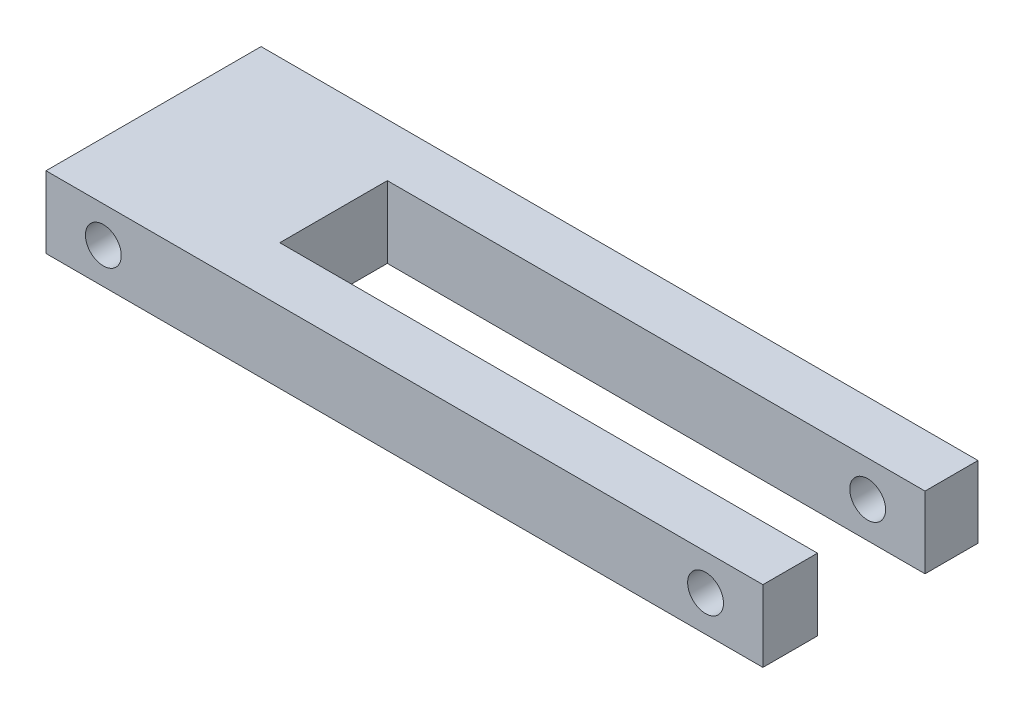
ISO-10303-21;
HEADER;
FILE_DESCRIPTION(('STEP AP214'),'2;1');
FILE_NAME('part.step','',(''),(''),'','','');
FILE_SCHEMA(('AUTOMOTIVE_DESIGN { 1 0 10303 214 1 1 1 1 }'));
ENDSEC;
DATA;
#1=APPLICATION_CONTEXT('core data for automotive mechanical design processes');
#2=APPLICATION_PROTOCOL_DEFINITION('international standard','automotive_design',2000,#1);
#3=PRODUCT_CONTEXT('',#1,'mechanical');
#4=PRODUCT('Part','Part','',(#3));
#5=PRODUCT_RELATED_PRODUCT_CATEGORY('part','',(#4));
#6=PRODUCT_DEFINITION_FORMATION('','',#4);
#7=PRODUCT_DEFINITION_CONTEXT('part definition',#1,'design');
#8=PRODUCT_DEFINITION('design','',#6,#7);
#9=PRODUCT_DEFINITION_SHAPE('','',#8);
#10=(LENGTH_UNIT() NAMED_UNIT(*) SI_UNIT(.MILLI.,.METRE.));
#11=(NAMED_UNIT(*) PLANE_ANGLE_UNIT() SI_UNIT($,.RADIAN.));
#12=(NAMED_UNIT(*) SI_UNIT($,.STERADIAN.) SOLID_ANGLE_UNIT());
#13=UNCERTAINTY_MEASURE_WITH_UNIT(LENGTH_MEASURE(1.E-05),#10,'distance_accuracy_value','');
#14=(GEOMETRIC_REPRESENTATION_CONTEXT(3) GLOBAL_UNCERTAINTY_ASSIGNED_CONTEXT((#13)) GLOBAL_UNIT_ASSIGNED_CONTEXT((#10,
#11,#12)) REPRESENTATION_CONTEXT('',''));
#15=CARTESIAN_POINT('',(0.,0.,0.));
#16=DIRECTION('',(0.,0.,1.));
#17=DIRECTION('',(1.,0.,0.));
#18=AXIS2_PLACEMENT_3D('',#15,#16,#17);
#19=CARTESIAN_POINT('',(-500.,-100.,152.207505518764));
#20=DIRECTION('',(0.,0.,-1.));
#21=DIRECTION('',(-1.,0.,0.));
#22=AXIS2_PLACEMENT_3D('',#19,#20,#21);
#23=PLANE('',#22);
#24=DIRECTION('',(-1.,0.,0.));
#25=VECTOR('',#24,1.);
#26=CARTESIAN_POINT('',(-500.,0.,152.207505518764));
#27=LINE('',#26,#25);
#28=CARTESIAN_POINT('',(500.,0.,152.207505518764));
#29=VERTEX_POINT('',#28);
#30=CARTESIAN_POINT('',(-500.,0.,152.207505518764));
#31=VERTEX_POINT('',#30);
#32=EDGE_CURVE('E128',#29,#31,#27,.T.);
#33=ORIENTED_EDGE('',*,*,#32,.T.);
#34=DIRECTION('',(0.,1.,0.));
#35=VECTOR('',#34,1.);
#36=CARTESIAN_POINT('',(-500.,-100.,152.207505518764));
#37=LINE('',#36,#35);
#38=CARTESIAN_POINT('',(-500.,-100.,152.207505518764));
#39=VERTEX_POINT('',#38);
#40=EDGE_CURVE('E125',#39,#31,#37,.T.);
#41=ORIENTED_EDGE('',*,*,#40,.F.);
#42=DIRECTION('',(-1.,0.,0.));
#43=VECTOR('',#42,1.);
#44=CARTESIAN_POINT('',(-500.,-100.,152.207505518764));
#45=LINE('',#44,#43);
#46=CARTESIAN_POINT('',(500.,-100.,152.207505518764));
#47=VERTEX_POINT('',#46);
#48=EDGE_CURVE('E113',#47,#39,#45,.T.);
#49=ORIENTED_EDGE('',*,*,#48,.F.);
#50=DIRECTION('',(0.,1.,0.));
#51=VECTOR('',#50,1.);
#52=CARTESIAN_POINT('',(500.,-100.,152.207505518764));
#53=LINE('',#52,#51);
#54=EDGE_CURVE('E130',#47,#29,#53,.T.);
#55=ORIENTED_EDGE('',*,*,#54,.T.);
#56=EDGE_LOOP('',(#33,#41,#49,#55));
#57=FACE_BOUND('',#56,.T.);
#58=CARTESIAN_POINT('',(-420.,-50.0000000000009,152.207505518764));
#59=DIRECTION('',(0.,0.,-1.));
#60=DIRECTION('',(-1.,0.,0.));
#61=AXIS2_PLACEMENT_3D('',#58,#59,#60);
#62=CIRCLE('',#61,25.);
#63=CARTESIAN_POINT('',(-445.,-50.0000000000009,152.207505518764));
#64=VERTEX_POINT('',#63);
#65=EDGE_CURVE('E221',#64,#64,#62,.T.);
#66=ORIENTED_EDGE('',*,*,#65,.T.);
#67=EDGE_LOOP('',(#66));
#68=FACE_BOUND('',#67,.T.);
#69=CARTESIAN_POINT('',(420.,-50.,152.207505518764));
#70=DIRECTION('',(0.,0.,-1.));
#71=DIRECTION('',(-1.,0.,0.));
#72=AXIS2_PLACEMENT_3D('',#69,#70,#71);
#73=CIRCLE('',#72,25.);
#74=CARTESIAN_POINT('',(395.,-50.,152.207505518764));
#75=VERTEX_POINT('',#74);
#76=EDGE_CURVE('E215',#75,#75,#73,.F.);
#77=ORIENTED_EDGE('',*,*,#76,.F.);
#78=EDGE_LOOP('',(#77));
#79=FACE_BOUND('',#78,.T.);
#80=ADVANCED_FACE('F39',(#57,#68,#79),#23,.F.);
#81=CARTESIAN_POINT('',(500.,-100.,-147.792494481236));
#82=DIRECTION('',(0.,0.,1.));
#83=DIRECTION('',(1.,0.,0.));
#84=AXIS2_PLACEMENT_3D('',#81,#82,#83);
#85=PLANE('',#84);
#86=DIRECTION('',(1.,0.,0.));
#87=VECTOR('',#86,1.);
#88=CARTESIAN_POINT('',(500.,0.,-147.792494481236));
#89=LINE('',#88,#87);
#90=CARTESIAN_POINT('',(-500.,0.,-147.792494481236));
#91=VERTEX_POINT('',#90);
#92=CARTESIAN_POINT('',(500.,0.,-147.792494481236));
#93=VERTEX_POINT('',#92);
#94=EDGE_CURVE('E92',#91,#93,#89,.T.);
#95=ORIENTED_EDGE('',*,*,#94,.T.);
#96=DIRECTION('',(0.,1.,0.));
#97=VECTOR('',#96,1.);
#98=CARTESIAN_POINT('',(500.,-100.,-147.792494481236));
#99=LINE('',#98,#97);
#100=CARTESIAN_POINT('',(500.,-100.,-147.792494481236));
#101=VERTEX_POINT('',#100);
#102=EDGE_CURVE('E137',#101,#93,#99,.T.);
#103=ORIENTED_EDGE('',*,*,#102,.F.);
#104=DIRECTION('',(1.,0.,0.));
#105=VECTOR('',#104,1.);
#106=CARTESIAN_POINT('',(500.,-100.,-147.792494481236));
#107=LINE('',#106,#105);
#108=CARTESIAN_POINT('',(-500.,-100.,-147.792494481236));
#109=VERTEX_POINT('',#108);
#110=EDGE_CURVE('E57',#109,#101,#107,.T.);
#111=ORIENTED_EDGE('',*,*,#110,.F.);
#112=DIRECTION('',(0.,1.,0.));
#113=VECTOR('',#112,1.);
#114=CARTESIAN_POINT('',(-500.,-100.,-147.792494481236));
#115=LINE('',#114,#113);
#116=EDGE_CURVE('E131',#109,#91,#115,.T.);
#117=ORIENTED_EDGE('',*,*,#116,.T.);
#118=EDGE_LOOP('',(#95,#103,#111,#117));
#119=FACE_BOUND('',#118,.T.);
#120=CARTESIAN_POINT('',(-420.,-50.0000000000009,-147.792494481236));
#121=DIRECTION('',(0.,0.,1.));
#122=DIRECTION('',(1.,0.,0.));
#123=AXIS2_PLACEMENT_3D('',#120,#121,#122);
#124=CIRCLE('',#123,25.);
#125=CARTESIAN_POINT('',(-445.,-50.0000000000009,-147.792494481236));
#126=VERTEX_POINT('',#125);
#127=EDGE_CURVE('E216',#126,#126,#124,.T.);
#128=ORIENTED_EDGE('',*,*,#127,.T.);
#129=EDGE_LOOP('',(#128));
#130=FACE_BOUND('',#129,.T.);
#131=CARTESIAN_POINT('',(420.,-50.,-147.792494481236));
#132=DIRECTION('',(0.,0.,-1.));
#133=DIRECTION('',(-1.,0.,0.));
#134=AXIS2_PLACEMENT_3D('',#131,#132,#133);
#135=CIRCLE('',#134,25.);
#136=CARTESIAN_POINT('',(395.,-50.,-147.792494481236));
#137=VERTEX_POINT('',#136);
#138=EDGE_CURVE('E220',#137,#137,#135,.T.);
#139=ORIENTED_EDGE('',*,*,#138,.F.);
#140=EDGE_LOOP('',(#139));
#141=FACE_BOUND('',#140,.T.);
#142=ADVANCED_FACE('F235',(#119,#130,#141),#85,.F.);
#143=CARTESIAN_POINT('',(500.,-100.,-147.792494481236));
#144=DIRECTION('',(-1.,0.,0.));
#145=DIRECTION('',(0.,0.,1.));
#146=AXIS2_PLACEMENT_3D('',#143,#144,#145);
#147=PLANE('',#146);
#148=DIRECTION('',(0.,0.,1.));
#149=VECTOR('',#148,1.);
#150=CARTESIAN_POINT('',(500.,0.,-147.792494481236));
#151=LINE('',#150,#149);
#152=CARTESIAN_POINT('',(500.,0.,-73.8962472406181));
#153=VERTEX_POINT('',#152);
#154=EDGE_CURVE('E141',#93,#153,#151,.T.);
#155=ORIENTED_EDGE('',*,*,#154,.T.);
#156=DIRECTION('',(0.,1.,0.));
#157=VECTOR('',#156,1.);
#158=CARTESIAN_POINT('',(500.,-100.,-73.8962472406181));
#159=LINE('',#158,#157);
#160=CARTESIAN_POINT('',(500.,-100.,-73.8962472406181));
#161=VERTEX_POINT('',#160);
#162=EDGE_CURVE('E11',#161,#153,#159,.T.);
#163=ORIENTED_EDGE('',*,*,#162,.F.);
#164=DIRECTION('',(0.,0.,1.));
#165=VECTOR('',#164,1.);
#166=CARTESIAN_POINT('',(500.,-100.,-147.792494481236));
#167=LINE('',#166,#165);
#168=EDGE_CURVE('E164',#101,#161,#167,.T.);
#169=ORIENTED_EDGE('',*,*,#168,.F.);
#170=ORIENTED_EDGE('',*,*,#102,.T.);
#171=EDGE_LOOP('',(#155,#163,#169,#170));
#172=FACE_BOUND('',#171,.T.);
#173=ADVANCED_FACE('F41',(#172),#147,.F.);
#174=CARTESIAN_POINT('',(500.,-100.,-73.8962472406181));
#175=DIRECTION('',(0.,0.,-1.));
#176=DIRECTION('',(-1.,0.,0.));
#177=AXIS2_PLACEMENT_3D('',#174,#175,#176);
#178=PLANE('',#177);
#179=CARTESIAN_POINT('',(420.,-50.,-73.8962472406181));
#180=DIRECTION('',(0.,0.,-1.));
#181=DIRECTION('',(-1.,0.,0.));
#182=AXIS2_PLACEMENT_3D('',#179,#180,#181);
#183=CIRCLE('',#182,25.);
#184=CARTESIAN_POINT('',(395.,-50.,-73.8962472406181));
#185=VERTEX_POINT('',#184);
#186=EDGE_CURVE('E146',#185,#185,#183,.T.);
#187=ORIENTED_EDGE('',*,*,#186,.T.);
#188=EDGE_LOOP('',(#187));
#189=FACE_BOUND('',#188,.T.);
#190=DIRECTION('',(-1.,0.,0.));
#191=VECTOR('',#190,1.);
#192=CARTESIAN_POINT('',(500.,0.,-73.8962472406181));
#193=LINE('',#192,#191);
#194=CARTESIAN_POINT('',(-250.,0.,-73.8962472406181));
#195=VERTEX_POINT('',#194);
#196=EDGE_CURVE('E145',#153,#195,#193,.T.);
#197=ORIENTED_EDGE('',*,*,#196,.T.);
#198=DIRECTION('',(0.,1.,0.));
#199=VECTOR('',#198,1.);
#200=CARTESIAN_POINT('',(-250.,-100.,-73.8962472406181));
#201=LINE('',#200,#199);
#202=CARTESIAN_POINT('',(-250.,-100.,-73.8962472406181));
#203=VERTEX_POINT('',#202);
#204=EDGE_CURVE('E49',#203,#195,#201,.T.);
#205=ORIENTED_EDGE('',*,*,#204,.F.);
#206=DIRECTION('',(-1.,0.,0.));
#207=VECTOR('',#206,1.);
#208=CARTESIAN_POINT('',(500.,-100.,-73.8962472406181));
#209=LINE('',#208,#207);
#210=EDGE_CURVE('E100',#161,#203,#209,.T.);
#211=ORIENTED_EDGE('',*,*,#210,.F.);
#212=ORIENTED_EDGE('',*,*,#162,.T.);
#213=EDGE_LOOP('',(#197,#205,#211,#212));
#214=FACE_BOUND('',#213,.T.);
#215=ADVANCED_FACE('F242',(#189,#214),#178,.F.);
#216=CARTESIAN_POINT('',(-250.,-100.,-73.8962472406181));
#217=DIRECTION('',(-1.,0.,0.));
#218=DIRECTION('',(0.,0.,1.));
#219=AXIS2_PLACEMENT_3D('',#216,#217,#218);
#220=PLANE('',#219);
#221=DIRECTION('',(0.,0.,1.));
#222=VECTOR('',#221,1.);
#223=CARTESIAN_POINT('',(-250.,0.,-73.8962472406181));
#224=LINE('',#223,#222);
#225=CARTESIAN_POINT('',(-250.,0.,76.1037527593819));
#226=VERTEX_POINT('',#225);
#227=EDGE_CURVE('E149',#195,#226,#224,.T.);
#228=ORIENTED_EDGE('',*,*,#227,.T.);
#229=DIRECTION('',(0.,1.,0.));
#230=VECTOR('',#229,1.);
#231=CARTESIAN_POINT('',(-250.,-100.,76.1037527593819));
#232=LINE('',#231,#230);
#233=CARTESIAN_POINT('',(-250.,-100.,76.1037527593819));
#234=VERTEX_POINT('',#233);
#235=EDGE_CURVE('E175',#234,#226,#232,.T.);
#236=ORIENTED_EDGE('',*,*,#235,.F.);
#237=DIRECTION('',(0.,0.,1.));
#238=VECTOR('',#237,1.);
#239=CARTESIAN_POINT('',(-250.,-100.,-73.8962472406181));
#240=LINE('',#239,#238);
#241=EDGE_CURVE('E185',#203,#234,#240,.T.);
#242=ORIENTED_EDGE('',*,*,#241,.F.);
#243=ORIENTED_EDGE('',*,*,#204,.T.);
#244=EDGE_LOOP('',(#228,#236,#242,#243));
#245=FACE_BOUND('',#244,.T.);
#246=ADVANCED_FACE('F183',(#245),#220,.F.);
#247=CARTESIAN_POINT('',(-250.,-100.,76.1037527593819));
#248=DIRECTION('',(0.,0.,1.));
#249=DIRECTION('',(1.,0.,0.));
#250=AXIS2_PLACEMENT_3D('',#247,#248,#249);
#251=PLANE('',#250);
#252=CARTESIAN_POINT('',(420.,-50.,76.1037527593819));
#253=DIRECTION('',(0.,0.,1.));
#254=DIRECTION('',(1.,0.,0.));
#255=AXIS2_PLACEMENT_3D('',#252,#253,#254);
#256=CIRCLE('',#255,25.);
#257=CARTESIAN_POINT('',(395.,-50.,76.1037527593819));
#258=VERTEX_POINT('',#257);
#259=EDGE_CURVE('E211',#258,#258,#256,.T.);
#260=ORIENTED_EDGE('',*,*,#259,.T.);
#261=EDGE_LOOP('',(#260));
#262=FACE_BOUND('',#261,.T.);
#263=DIRECTION('',(1.,0.,0.));
#264=VECTOR('',#263,1.);
#265=CARTESIAN_POINT('',(-250.,0.,76.1037527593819));
#266=LINE('',#265,#264);
#267=CARTESIAN_POINT('',(500.,0.,76.1037527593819));
#268=VERTEX_POINT('',#267);
#269=EDGE_CURVE('E152',#226,#268,#266,.T.);
#270=ORIENTED_EDGE('',*,*,#269,.T.);
#271=DIRECTION('',(0.,1.,0.));
#272=VECTOR('',#271,1.);
#273=CARTESIAN_POINT('',(500.,-100.,76.1037527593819));
#274=LINE('',#273,#272);
#275=CARTESIAN_POINT('',(500.,-100.,76.1037527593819));
#276=VERTEX_POINT('',#275);
#277=EDGE_CURVE('E171',#276,#268,#274,.T.);
#278=ORIENTED_EDGE('',*,*,#277,.F.);
#279=DIRECTION('',(1.,0.,0.));
#280=VECTOR('',#279,1.);
#281=CARTESIAN_POINT('',(-250.,-100.,76.1037527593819));
#282=LINE('',#281,#280);
#283=EDGE_CURVE('E198',#234,#276,#282,.T.);
#284=ORIENTED_EDGE('',*,*,#283,.F.);
#285=ORIENTED_EDGE('',*,*,#235,.T.);
#286=EDGE_LOOP('',(#270,#278,#284,#285));
#287=FACE_BOUND('',#286,.T.);
#288=ADVANCED_FACE('F193',(#262,#287),#251,.F.);
#289=CARTESIAN_POINT('',(500.,-100.,76.1037527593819));
#290=DIRECTION('',(-1.,0.,0.));
#291=DIRECTION('',(0.,0.,1.));
#292=AXIS2_PLACEMENT_3D('',#289,#290,#291);
#293=PLANE('',#292);
#294=DIRECTION('',(0.,0.,1.));
#295=VECTOR('',#294,1.);
#296=CARTESIAN_POINT('',(500.,0.,76.1037527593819));
#297=LINE('',#296,#295);
#298=EDGE_CURVE('E155',#268,#29,#297,.T.);
#299=ORIENTED_EDGE('',*,*,#298,.T.);
#300=ORIENTED_EDGE('',*,*,#54,.F.);
#301=DIRECTION('',(0.,0.,1.));
#302=VECTOR('',#301,1.);
#303=CARTESIAN_POINT('',(500.,-100.,76.1037527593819));
#304=LINE('',#303,#302);
#305=EDGE_CURVE('E119',#276,#47,#304,.T.);
#306=ORIENTED_EDGE('',*,*,#305,.F.);
#307=ORIENTED_EDGE('',*,*,#277,.T.);
#308=EDGE_LOOP('',(#299,#300,#306,#307));
#309=FACE_BOUND('',#308,.T.);
#310=ADVANCED_FACE('F196',(#309),#293,.F.);
#311=CARTESIAN_POINT('',(-500.,-100.,-147.792494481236));
#312=DIRECTION('',(1.,0.,0.));
#313=DIRECTION('',(0.,0.,-1.));
#314=AXIS2_PLACEMENT_3D('',#311,#312,#313);
#315=PLANE('',#314);
#316=DIRECTION('',(0.,0.,-1.));
#317=VECTOR('',#316,1.);
#318=CARTESIAN_POINT('',(-500.,0.,-147.792494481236));
#319=LINE('',#318,#317);
#320=EDGE_CURVE('E86',#31,#91,#319,.T.);
#321=ORIENTED_EDGE('',*,*,#320,.T.);
#322=ORIENTED_EDGE('',*,*,#116,.F.);
#323=DIRECTION('',(0.,0.,-1.));
#324=VECTOR('',#323,1.);
#325=CARTESIAN_POINT('',(-500.,-100.,-147.792494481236));
#326=LINE('',#325,#324);
#327=EDGE_CURVE('E117',#39,#109,#326,.T.);
#328=ORIENTED_EDGE('',*,*,#327,.F.);
#329=ORIENTED_EDGE('',*,*,#40,.T.);
#330=EDGE_LOOP('',(#321,#322,#328,#329));
#331=FACE_BOUND('',#330,.T.);
#332=ADVANCED_FACE('F133',(#331),#315,.F.);
#333=CARTESIAN_POINT('',(0.,-100.,0.));
#334=DIRECTION('',(0.,-1.,0.));
#335=DIRECTION('',(0.,0.,-1.));
#336=AXIS2_PLACEMENT_3D('',#333,#334,#335);
#337=PLANE('',#336);
#338=ORIENTED_EDGE('',*,*,#168,.T.);
#339=ORIENTED_EDGE('',*,*,#210,.T.);
#340=ORIENTED_EDGE('',*,*,#241,.T.);
#341=ORIENTED_EDGE('',*,*,#283,.T.);
#342=ORIENTED_EDGE('',*,*,#305,.T.);
#343=ORIENTED_EDGE('',*,*,#48,.T.);
#344=ORIENTED_EDGE('',*,*,#327,.T.);
#345=ORIENTED_EDGE('',*,*,#110,.T.);
#346=EDGE_LOOP('',(#338,#339,#340,#341,#342,#343,#344,#345));
#347=FACE_BOUND('',#346,.T.);
#348=ADVANCED_FACE('F115',(#347),#337,.T.);
#349=CARTESIAN_POINT('',(0.,0.,0.));
#350=DIRECTION('',(0.,-1.,0.));
#351=DIRECTION('',(0.,0.,-1.));
#352=AXIS2_PLACEMENT_3D('',#349,#350,#351);
#353=PLANE('',#352);
#354=ORIENTED_EDGE('',*,*,#154,.F.);
#355=ORIENTED_EDGE('',*,*,#94,.F.);
#356=ORIENTED_EDGE('',*,*,#320,.F.);
#357=ORIENTED_EDGE('',*,*,#32,.F.);
#358=ORIENTED_EDGE('',*,*,#298,.F.);
#359=ORIENTED_EDGE('',*,*,#269,.F.);
#360=ORIENTED_EDGE('',*,*,#227,.F.);
#361=ORIENTED_EDGE('',*,*,#196,.F.);
#362=EDGE_LOOP('',(#354,#355,#356,#357,#358,#359,#360,#361));
#363=FACE_BOUND('',#362,.T.);
#364=ADVANCED_FACE('F189',(#363),#353,.F.);
#365=CARTESIAN_POINT('',(-420.,-50.0000000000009,222.918183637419));
#366=DIRECTION('',(0.,0.,-1.));
#367=DIRECTION('',(-1.,0.,0.));
#368=AXIS2_PLACEMENT_3D('',#365,#366,#367);
#369=CYLINDRICAL_SURFACE('',#368,25.);
#370=CARTESIAN_POINT('',(-445.,-50.0000000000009,152.207505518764));
#371=CARTESIAN_POINT('',(-445.,-50.0000000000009,149.082505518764));
#372=CARTESIAN_POINT('',(-445.,-50.0000000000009,145.957505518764));
#373=CARTESIAN_POINT('',(-445.,-50.0000000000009,139.707505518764));
#374=CARTESIAN_POINT('',(-445.,-50.0000000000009,136.582505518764));
#375=CARTESIAN_POINT('',(-445.,-50.0000000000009,130.332505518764));
#376=CARTESIAN_POINT('',(-445.,-50.0000000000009,127.207505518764));
#377=CARTESIAN_POINT('',(-445.,-50.0000000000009,120.957505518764));
#378=CARTESIAN_POINT('',(-445.,-50.0000000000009,117.832505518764));
#379=CARTESIAN_POINT('',(-445.,-50.0000000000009,111.582505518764));
#380=CARTESIAN_POINT('',(-445.,-50.0000000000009,108.457505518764));
#381=CARTESIAN_POINT('',(-445.,-50.0000000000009,102.207505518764));
#382=CARTESIAN_POINT('',(-445.,-50.0000000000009,99.0825055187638));
#383=CARTESIAN_POINT('',(-445.,-50.0000000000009,92.8325055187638));
#384=CARTESIAN_POINT('',(-445.,-50.0000000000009,89.7075055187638));
#385=CARTESIAN_POINT('',(-445.,-50.0000000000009,83.4575055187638));
#386=CARTESIAN_POINT('',(-445.,-50.0000000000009,80.3325055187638));
#387=CARTESIAN_POINT('',(-445.,-50.0000000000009,74.0825055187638));
#388=CARTESIAN_POINT('',(-445.,-50.0000000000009,70.9575055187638));
#389=CARTESIAN_POINT('',(-445.,-50.0000000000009,64.7075055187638));
#390=CARTESIAN_POINT('',(-445.,-50.0000000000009,61.5825055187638));
#391=CARTESIAN_POINT('',(-445.,-50.0000000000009,55.3325055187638));
#392=CARTESIAN_POINT('',(-445.,-50.0000000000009,52.2075055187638));
#393=CARTESIAN_POINT('',(-445.,-50.0000000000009,45.9575055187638));
#394=CARTESIAN_POINT('',(-445.,-50.0000000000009,42.8325055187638));
#395=CARTESIAN_POINT('',(-445.,-50.0000000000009,36.5825055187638));
#396=CARTESIAN_POINT('',(-445.,-50.0000000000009,33.4575055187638));
#397=CARTESIAN_POINT('',(-445.,-50.0000000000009,27.2075055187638));
#398=CARTESIAN_POINT('',(-445.,-50.0000000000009,24.0825055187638));
#399=CARTESIAN_POINT('',(-445.,-50.0000000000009,17.8325055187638));
#400=CARTESIAN_POINT('',(-445.,-50.0000000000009,14.7075055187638));
#401=CARTESIAN_POINT('',(-445.,-50.0000000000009,8.45750551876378));
#402=CARTESIAN_POINT('',(-445.,-50.0000000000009,5.33250551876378));
#403=CARTESIAN_POINT('',(-445.,-50.0000000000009,-0.917494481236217));
#404=CARTESIAN_POINT('',(-445.,-50.0000000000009,-4.04249448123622));
#405=CARTESIAN_POINT('',(-445.,-50.0000000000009,-10.2924944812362));
#406=CARTESIAN_POINT('',(-445.,-50.0000000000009,-13.4174944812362));
#407=CARTESIAN_POINT('',(-445.,-50.0000000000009,-19.6674944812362));
#408=CARTESIAN_POINT('',(-445.,-50.0000000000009,-22.7924944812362));
#409=CARTESIAN_POINT('',(-445.,-50.0000000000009,-29.0424944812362));
#410=CARTESIAN_POINT('',(-445.,-50.0000000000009,-32.1674944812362));
#411=CARTESIAN_POINT('',(-445.,-50.0000000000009,-38.4174944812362));
#412=CARTESIAN_POINT('',(-445.,-50.0000000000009,-41.5424944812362));
#413=CARTESIAN_POINT('',(-445.,-50.0000000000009,-47.7924944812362));
#414=CARTESIAN_POINT('',(-445.,-50.0000000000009,-50.9174944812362));
#415=CARTESIAN_POINT('',(-445.,-50.0000000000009,-57.1674944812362));
#416=CARTESIAN_POINT('',(-445.,-50.0000000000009,-60.2924944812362));
#417=CARTESIAN_POINT('',(-445.,-50.0000000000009,-66.5424944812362));
#418=CARTESIAN_POINT('',(-445.,-50.0000000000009,-69.6674944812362));
#419=CARTESIAN_POINT('',(-445.,-50.0000000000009,-75.9174944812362));
#420=CARTESIAN_POINT('',(-445.,-50.0000000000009,-79.0424944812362));
#421=CARTESIAN_POINT('',(-445.,-50.0000000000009,-85.2924944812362));
#422=CARTESIAN_POINT('',(-445.,-50.0000000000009,-88.4174944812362));
#423=CARTESIAN_POINT('',(-445.,-50.0000000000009,-94.6674944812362));
#424=CARTESIAN_POINT('',(-445.,-50.0000000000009,-97.7924944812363));
#425=CARTESIAN_POINT('',(-445.,-50.0000000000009,-104.042494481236));
#426=CARTESIAN_POINT('',(-445.,-50.0000000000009,-107.167494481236));
#427=CARTESIAN_POINT('',(-445.,-50.0000000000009,-113.417494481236));
#428=CARTESIAN_POINT('',(-445.,-50.0000000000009,-116.542494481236));
#429=CARTESIAN_POINT('',(-445.,-50.0000000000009,-122.792494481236));
#430=CARTESIAN_POINT('',(-445.,-50.0000000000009,-125.917494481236));
#431=CARTESIAN_POINT('',(-445.,-50.0000000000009,-132.167494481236));
#432=CARTESIAN_POINT('',(-445.,-50.0000000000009,-135.292494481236));
#433=CARTESIAN_POINT('',(-445.,-50.0000000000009,-141.542494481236));
#434=CARTESIAN_POINT('',(-445.,-50.0000000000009,-144.667494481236));
#435=CARTESIAN_POINT('',(-445.,-50.0000000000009,-147.792494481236));
#436=B_SPLINE_CURVE_WITH_KNOTS('',3,(#370,#371,#372,#373,#374,#375,#376,#377,#378,#379,#380,
#381,#382,#383,#384,#385,#386,#387,#388,#389,#390,#391,#392,#393,#394,#395,#396,#397,#398,#399,
#400,#401,#402,#403,#404,#405,#406,#407,#408,#409,#410,#411,#412,#413,#414,#415,#416,#417,#418,
#419,#420,#421,#422,#423,#424,#425,#426,#427,#428,#429,#430,#431,#432,#433,#434,#435),
.UNSPECIFIED.,.F.,.F.,(4,2,2,2,2,2,2,2,2,2,2,2,2,2,2,2,2,2,2,2,2,2,2,2,2,2,2,2,2,2,2,2,4),(0.,
9.37499999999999,18.75,28.125,37.5,46.875,56.25,65.625,75.,84.375,93.75,103.125,112.5,121.875,
131.25,140.625,150.,159.375,168.75,178.125,187.5,196.875,206.25,215.625,225.,234.375,243.75,
253.125,262.5,271.875,281.25,290.625,300.),.UNSPECIFIED.);
#437=EDGE_CURVE('BSEAM266',#64,#126,#436,.T.);
#438=ORIENTED_EDGE('',*,*,#65,.F.);
#439=ORIENTED_EDGE('',*,*,#127,.F.);
#440=ORIENTED_EDGE('',*,*,#437,.T.);
#441=ORIENTED_EDGE('',*,*,#437,.F.);
#442=EDGE_LOOP('',(#438,#440,#439,#441));
#443=FACE_BOUND('',#442,.T.);
#444=ADVANCED_FACE('F266',(#443),#369,.F.);
#445=CARTESIAN_POINT('',(420.,-50.,222.918183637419));
#446=DIRECTION('',(0.,0.,-1.));
#447=DIRECTION('',(-1.,0.,0.));
#448=AXIS2_PLACEMENT_3D('',#445,#446,#447);
#449=CYLINDRICAL_SURFACE('',#448,25.);
#450=CARTESIAN_POINT('',(395.,-50.,-147.792494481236));
#451=CARTESIAN_POINT('',(395.,-50.,-147.022741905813));
#452=CARTESIAN_POINT('',(395.,-50.,-146.25298933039));
#453=CARTESIAN_POINT('',(395.,-50.,-144.713484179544));
#454=CARTESIAN_POINT('',(395.,-50.,-143.943731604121));
#455=CARTESIAN_POINT('',(395.,-50.,-142.404226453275));
#456=CARTESIAN_POINT('',(395.,-50.,-141.634473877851));
#457=CARTESIAN_POINT('',(395.,-50.,-140.094968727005));
#458=CARTESIAN_POINT('',(395.,-50.,-139.325216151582));
#459=CARTESIAN_POINT('',(395.,-50.,-137.785711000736));
#460=CARTESIAN_POINT('',(395.,-50.,-137.015958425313));
#461=CARTESIAN_POINT('',(395.,-50.,-135.476453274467));
#462=CARTESIAN_POINT('',(395.,-50.,-134.706700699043));
#463=CARTESIAN_POINT('',(395.,-50.,-133.167195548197));
#464=CARTESIAN_POINT('',(395.,-50.,-132.397442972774));
#465=CARTESIAN_POINT('',(395.,-50.,-130.857937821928));
#466=CARTESIAN_POINT('',(395.,-50.,-130.088185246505));
#467=CARTESIAN_POINT('',(395.,-50.,-128.548680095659));
#468=CARTESIAN_POINT('',(395.,-50.,-127.778927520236));
#469=CARTESIAN_POINT('',(395.,-50.,-126.239422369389));
#470=CARTESIAN_POINT('',(395.,-50.,-125.469669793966));
#471=CARTESIAN_POINT('',(395.,-50.,-123.93016464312));
#472=CARTESIAN_POINT('',(395.,-50.,-123.160412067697));
#473=CARTESIAN_POINT('',(395.,-50.,-121.620906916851));
#474=CARTESIAN_POINT('',(395.,-50.,-120.851154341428));
#475=CARTESIAN_POINT('',(395.,-50.,-119.311649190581));
#476=CARTESIAN_POINT('',(395.,-50.,-118.541896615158));
#477=CARTESIAN_POINT('',(395.,-50.,-117.002391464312));
#478=CARTESIAN_POINT('',(395.,-50.,-116.232638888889));
#479=CARTESIAN_POINT('',(395.,-50.,-114.693133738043));
#480=CARTESIAN_POINT('',(395.,-50.,-113.92338116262));
#481=CARTESIAN_POINT('',(395.,-50.,-112.383876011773));
#482=CARTESIAN_POINT('',(395.,-50.,-111.61412343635));
#483=CARTESIAN_POINT('',(395.,-50.,-110.074618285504));
#484=CARTESIAN_POINT('',(395.,-50.,-109.304865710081));
#485=CARTESIAN_POINT('',(395.,-50.,-107.765360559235));
#486=CARTESIAN_POINT('',(395.,-50.,-106.995607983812));
#487=CARTESIAN_POINT('',(395.,-50.,-105.456102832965));
#488=CARTESIAN_POINT('',(395.,-50.,-104.686350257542));
#489=CARTESIAN_POINT('',(395.,-50.,-103.146845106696));
#490=CARTESIAN_POINT('',(395.,-50.,-102.377092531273));
#491=CARTESIAN_POINT('',(395.,-50.,-100.837587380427));
#492=CARTESIAN_POINT('',(395.,-50.,-100.067834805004));
#493=CARTESIAN_POINT('',(395.,-50.,-98.5283296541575));
#494=CARTESIAN_POINT('',(395.,-50.,-97.7585770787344));
#495=CARTESIAN_POINT('',(395.,-50.,-96.2190719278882));
#496=CARTESIAN_POINT('',(395.,-50.,-95.4493193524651));
#497=CARTESIAN_POINT('',(395.,-50.,-93.9098142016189));
#498=CARTESIAN_POINT('',(395.,-50.,-93.1400616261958));
#499=CARTESIAN_POINT('',(395.,-50.,-91.6005564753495));
#500=CARTESIAN_POINT('',(395.,-50.,-90.8308038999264));
#501=CARTESIAN_POINT('',(395.,-50.,-89.2912987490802));
#502=CARTESIAN_POINT('',(395.,-50.,-88.5215461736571));
#503=CARTESIAN_POINT('',(395.,-50.,-86.9820410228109));
#504=CARTESIAN_POINT('',(395.,-50.,-86.2122884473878));
#505=CARTESIAN_POINT('',(395.,-50.,-84.6727832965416));
#506=CARTESIAN_POINT('',(395.,-50.,-83.9030307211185));
#507=CARTESIAN_POINT('',(395.,-50.,-82.3635255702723));
#508=CARTESIAN_POINT('',(395.,-50.,-81.5937729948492));
#509=CARTESIAN_POINT('',(395.,-50.,-80.054267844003));
#510=CARTESIAN_POINT('',(395.,-50.,-79.2845152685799));
#511=CARTESIAN_POINT('',(395.,-50.,-77.7450101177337));
#512=CARTESIAN_POINT('',(395.,-50.,-76.9752575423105));
#513=CARTESIAN_POINT('',(395.,-50.,-75.4357523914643));
#514=CARTESIAN_POINT('',(395.,-50.,-74.6659998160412));
#515=CARTESIAN_POINT('',(395.,-50.,-73.8962472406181));
#516=B_SPLINE_CURVE_WITH_KNOTS('',3,(#450,#451,#452,#453,#454,#455,#456,#457,#458,#459,#460,
#461,#462,#463,#464,#465,#466,#467,#468,#469,#470,#471,#472,#473,#474,#475,#476,#477,#478,#479,
#480,#481,#482,#483,#484,#485,#486,#487,#488,#489,#490,#491,#492,#493,#494,#495,#496,#497,#498,
#499,#500,#501,#502,#503,#504,#505,#506,#507,#508,#509,#510,#511,#512,#513,#514,#515),
.UNSPECIFIED.,.F.,.F.,(4,2,2,2,2,2,2,2,2,2,2,2,2,2,2,2,2,2,2,2,2,2,2,2,2,2,2,2,2,2,2,2,4),(0.,
2.30925772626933,4.61851545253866,6.92777317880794,9.23703090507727,11.5462886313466,
13.8555463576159,16.1648040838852,18.4740618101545,20.7833195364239,23.0925772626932,
25.4018349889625,27.7110927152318,30.0203504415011,32.3296081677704,34.6388658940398,
36.9481236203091,39.2573813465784,41.5666390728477,43.875896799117,46.1851545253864,
48.4944122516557,50.803669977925,53.1129277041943,55.4221854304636,57.731443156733,
60.0407008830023,62.3499586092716,64.6592163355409,66.9684740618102,69.2777317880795,
71.5869895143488,73.8962472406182),.UNSPECIFIED.);
#517=EDGE_CURVE('BSEAM232',#137,#185,#516,.T.);
#518=ORIENTED_EDGE('',*,*,#138,.T.);
#519=ORIENTED_EDGE('',*,*,#186,.F.);
#520=ORIENTED_EDGE('',*,*,#517,.T.);
#521=ORIENTED_EDGE('',*,*,#517,.F.);
#522=EDGE_LOOP('',(#518,#520,#519,#521));
#523=FACE_BOUND('',#522,.T.);
#524=ADVANCED_FACE('F232',(#523),#449,.F.);
#525=CARTESIAN_POINT('',(395.,-50.,152.207505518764));
#526=CARTESIAN_POINT('',(395.,-50.,151.414758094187));
#527=CARTESIAN_POINT('',(395.,-50.,150.62201066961));
#528=CARTESIAN_POINT('',(395.,-50.,149.036515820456));
#529=CARTESIAN_POINT('',(395.,-50.,148.243768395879));
#530=CARTESIAN_POINT('',(395.,-50.,146.658273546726));
#531=CARTESIAN_POINT('',(395.,-50.,145.865526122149));
#532=CARTESIAN_POINT('',(395.,-50.,144.280031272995));
#533=CARTESIAN_POINT('',(395.,-50.,143.487283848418));
#534=CARTESIAN_POINT('',(395.,-50.,141.901788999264));
#535=CARTESIAN_POINT('',(395.,-50.,141.109041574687));
#536=CARTESIAN_POINT('',(395.,-50.,139.523546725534));
#537=CARTESIAN_POINT('',(395.,-50.,138.730799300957));
#538=CARTESIAN_POINT('',(395.,-50.,137.145304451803));
#539=CARTESIAN_POINT('',(395.,-50.,136.352557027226));
#540=CARTESIAN_POINT('',(395.,-50.,134.767062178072));
#541=CARTESIAN_POINT('',(395.,-50.,133.974314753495));
#542=CARTESIAN_POINT('',(395.,-50.,132.388819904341));
#543=CARTESIAN_POINT('',(395.,-50.,131.596072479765));
#544=CARTESIAN_POINT('',(395.,-50.,130.010577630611));
#545=CARTESIAN_POINT('',(395.,-50.,129.217830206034));
#546=CARTESIAN_POINT('',(395.,-50.,127.63233535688));
#547=CARTESIAN_POINT('',(395.,-50.,126.839587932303));
#548=CARTESIAN_POINT('',(395.,-50.,125.254093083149));
#549=CARTESIAN_POINT('',(395.,-50.,124.461345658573));
#550=CARTESIAN_POINT('',(395.,-50.,122.875850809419));
#551=CARTESIAN_POINT('',(395.,-50.,122.083103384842));
#552=CARTESIAN_POINT('',(395.,-50.,120.497608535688));
#553=CARTESIAN_POINT('',(395.,-50.,119.704861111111));
#554=CARTESIAN_POINT('',(395.,-50.,118.119366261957));
#555=CARTESIAN_POINT('',(395.,-50.,117.32661883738));
#556=CARTESIAN_POINT('',(395.,-50.,115.741123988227));
#557=CARTESIAN_POINT('',(395.,-50.,114.94837656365));
#558=CARTESIAN_POINT('',(395.,-50.,113.362881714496));
#559=CARTESIAN_POINT('',(395.,-50.,112.570134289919));
#560=CARTESIAN_POINT('',(395.,-50.,110.984639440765));
#561=CARTESIAN_POINT('',(395.,-50.,110.191892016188));
#562=CARTESIAN_POINT('',(395.,-50.,108.606397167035));
#563=CARTESIAN_POINT('',(395.,-50.,107.813649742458));
#564=CARTESIAN_POINT('',(395.,-50.,106.228154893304));
#565=CARTESIAN_POINT('',(395.,-50.,105.435407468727));
#566=CARTESIAN_POINT('',(395.,-50.,103.849912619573));
#567=CARTESIAN_POINT('',(395.,-50.,103.057165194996));
#568=CARTESIAN_POINT('',(395.,-50.,101.471670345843));
#569=CARTESIAN_POINT('',(395.,-50.,100.678922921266));
#570=CARTESIAN_POINT('',(395.,-50.,99.0934280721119));
#571=CARTESIAN_POINT('',(395.,-50.,98.300680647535));
#572=CARTESIAN_POINT('',(395.,-50.,96.7151857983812));
#573=CARTESIAN_POINT('',(395.,-50.,95.9224383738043));
#574=CARTESIAN_POINT('',(395.,-50.,94.3369435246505));
#575=CARTESIAN_POINT('',(395.,-50.,93.5441961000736));
#576=CARTESIAN_POINT('',(395.,-50.,91.9587012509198));
#577=CARTESIAN_POINT('',(395.,-50.,91.1659538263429));
#578=CARTESIAN_POINT('',(395.,-50.,89.5804589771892));
#579=CARTESIAN_POINT('',(395.,-50.,88.7877115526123));
#580=CARTESIAN_POINT('',(395.,-50.,87.2022167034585));
#581=CARTESIAN_POINT('',(395.,-50.,86.4094692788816));
#582=CARTESIAN_POINT('',(395.,-50.,84.8239744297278));
#583=CARTESIAN_POINT('',(395.,-50.,84.0312270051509));
#584=CARTESIAN_POINT('',(395.,-50.,82.4457321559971));
#585=CARTESIAN_POINT('',(395.,-50.,81.6529847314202));
#586=CARTESIAN_POINT('',(395.,-50.,80.0674898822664));
#587=CARTESIAN_POINT('',(395.,-50.,79.2747424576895));
#588=CARTESIAN_POINT('',(395.,-50.,77.6892476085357));
#589=CARTESIAN_POINT('',(395.,-50.,76.8965001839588));
#590=CARTESIAN_POINT('',(395.,-50.,76.1037527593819));
#591=B_SPLINE_CURVE_WITH_KNOTS('',3,(#525,#526,#527,#528,#529,#530,#531,#532,#533,#534,#535,
#536,#537,#538,#539,#540,#541,#542,#543,#544,#545,#546,#547,#548,#549,#550,#551,#552,#553,#554,
#555,#556,#557,#558,#559,#560,#561,#562,#563,#564,#565,#566,#567,#568,#569,#570,#571,#572,#573,
#574,#575,#576,#577,#578,#579,#580,#581,#582,#583,#584,#585,#586,#587,#588,#589,#590),
.UNSPECIFIED.,.F.,.F.,(4,2,2,2,2,2,2,2,2,2,2,2,2,2,2,2,2,2,2,2,2,2,2,2,2,2,2,2,2,2,2,2,4),(0.,
2.37824227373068,4.75648454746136,7.13472682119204,9.51296909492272,11.8912113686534,
14.2694536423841,16.6476959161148,19.0259381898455,21.4041804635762,23.7824227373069,
26.1606650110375,28.5389072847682,30.9171495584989,33.2953918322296,35.6736341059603,
38.0518763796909,40.4301186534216,42.8083609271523,45.186603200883,47.5648454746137,
49.9430877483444,52.3213300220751,54.6995722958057,57.0778145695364,59.4560568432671,
61.8342991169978,64.2125413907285,66.5907836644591,68.9690259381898,71.3472682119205,
73.7255104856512,76.1037527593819),.UNSPECIFIED.);
#592=EDGE_CURVE('BSEAM265',#75,#258,#591,.T.);
#593=ORIENTED_EDGE('',*,*,#76,.T.);
#594=ORIENTED_EDGE('',*,*,#259,.F.);
#595=ORIENTED_EDGE('',*,*,#592,.T.);
#596=ORIENTED_EDGE('',*,*,#592,.F.);
#597=EDGE_LOOP('',(#593,#595,#594,#596));
#598=FACE_BOUND('',#597,.T.);
#599=ADVANCED_FACE('F265',(#598),#449,.F.);
#600=CLOSED_SHELL('',(#80,#142,#173,#215,#246,#288,#310,#332,#348,#364,#444,#524,#599));
#601=MANIFOLD_SOLID_BREP('B2',#600);
#602=ADVANCED_BREP_SHAPE_REPRESENTATION('',(#18,#601),#14);
#603=SHAPE_DEFINITION_REPRESENTATION(#9,#602);
ENDSEC;
END-ISO-10303-21;
